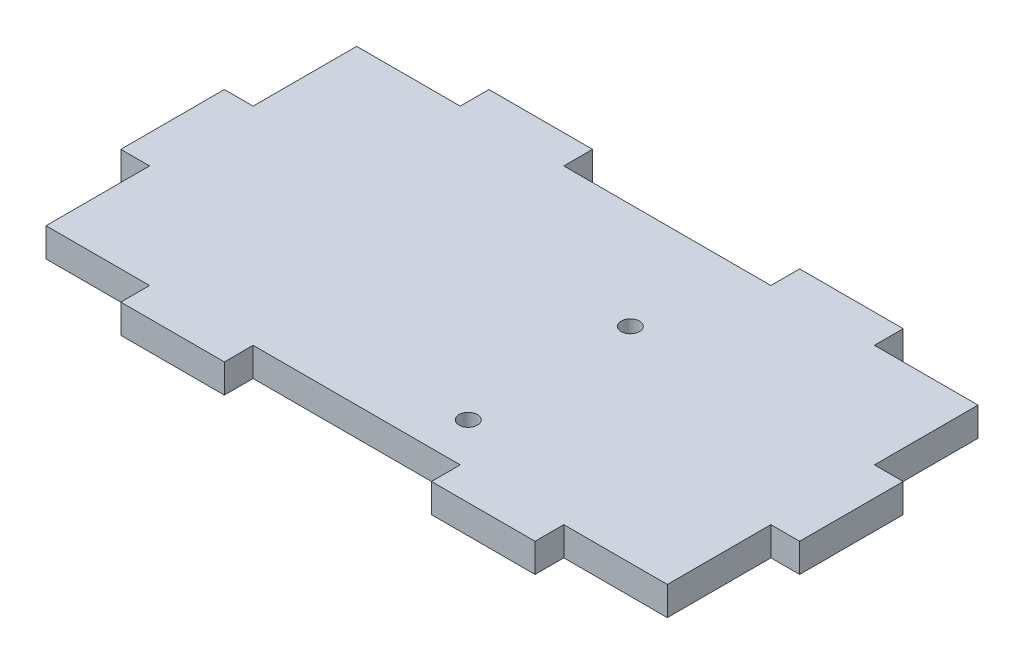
ISO-10303-21;
HEADER;
FILE_DESCRIPTION(('STEP AP214'),'2;1');
FILE_NAME('part.step','',(''),(''),'','','');
FILE_SCHEMA(('AUTOMOTIVE_DESIGN { 1 0 10303 214 1 1 1 1 }'));
ENDSEC;
DATA;
#1=APPLICATION_CONTEXT('core data for automotive mechanical design processes');
#2=APPLICATION_PROTOCOL_DEFINITION('international standard','automotive_design',2000,#1);
#3=PRODUCT_CONTEXT('',#1,'mechanical');
#4=PRODUCT('Part','Part','',(#3));
#5=PRODUCT_RELATED_PRODUCT_CATEGORY('part','',(#4));
#6=PRODUCT_DEFINITION_FORMATION('','',#4);
#7=PRODUCT_DEFINITION_CONTEXT('part definition',#1,'design');
#8=PRODUCT_DEFINITION('design','',#6,#7);
#9=PRODUCT_DEFINITION_SHAPE('','',#8);
#10=(LENGTH_UNIT() NAMED_UNIT(*) SI_UNIT(.MILLI.,.METRE.));
#11=(NAMED_UNIT(*) PLANE_ANGLE_UNIT() SI_UNIT($,.RADIAN.));
#12=(NAMED_UNIT(*) SI_UNIT($,.STERADIAN.) SOLID_ANGLE_UNIT());
#13=UNCERTAINTY_MEASURE_WITH_UNIT(LENGTH_MEASURE(1.E-05),#10,'distance_accuracy_value','');
#14=(GEOMETRIC_REPRESENTATION_CONTEXT(3) GLOBAL_UNCERTAINTY_ASSIGNED_CONTEXT((#13)) GLOBAL_UNIT_ASSIGNED_CONTEXT((#10,
#11,#12)) REPRESENTATION_CONTEXT('',''));
#15=CARTESIAN_POINT('',(0.,0.,0.));
#16=DIRECTION('',(0.,0.,1.));
#17=DIRECTION('',(1.,0.,0.));
#18=AXIS2_PLACEMENT_3D('',#15,#16,#17);
#19=CARTESIAN_POINT('',(-54.,5.,-27.));
#20=DIRECTION('',(1.,0.,0.));
#21=DIRECTION('',(0.,0.,-1.));
#22=AXIS2_PLACEMENT_3D('',#19,#20,#21);
#23=PLANE('',#22);
#24=DIRECTION('',(0.,1.,0.));
#25=VECTOR('',#24,1.);
#26=CARTESIAN_POINT('',(-54.,-18.6815416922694,9.));
#27=LINE('',#26,#25);
#28=CARTESIAN_POINT('',(-54.,0.,9.));
#29=VERTEX_POINT('',#28);
#30=CARTESIAN_POINT('',(-54.,5.,9.));
#31=VERTEX_POINT('',#30);
#32=EDGE_CURVE('E241',#29,#31,#27,.T.);
#33=ORIENTED_EDGE('',*,*,#32,.F.);
#34=DIRECTION('',(0.,0.,1.));
#35=VECTOR('',#34,1.);
#36=CARTESIAN_POINT('',(-54.,0.,-27.));
#37=LINE('',#36,#35);
#38=CARTESIAN_POINT('',(-54.,0.,27.));
#39=VERTEX_POINT('',#38);
#40=EDGE_CURVE('E411',#29,#39,#37,.T.);
#41=ORIENTED_EDGE('',*,*,#40,.T.);
#42=DIRECTION('',(0.,-1.,0.));
#43=VECTOR('',#42,1.);
#44=CARTESIAN_POINT('',(-54.,5.,27.));
#45=LINE('',#44,#43);
#46=CARTESIAN_POINT('',(-54.,5.,27.));
#47=VERTEX_POINT('',#46);
#48=EDGE_CURVE('E421',#47,#39,#45,.T.);
#49=ORIENTED_EDGE('',*,*,#48,.F.);
#50=DIRECTION('',(0.,0.,1.));
#51=VECTOR('',#50,1.);
#52=CARTESIAN_POINT('',(-54.,5.,-27.));
#53=LINE('',#52,#51);
#54=EDGE_CURVE('E398',#31,#47,#53,.T.);
#55=ORIENTED_EDGE('',*,*,#54,.F.);
#56=EDGE_LOOP('',(#33,#41,#49,#55));
#57=FACE_BOUND('',#56,.T.);
#58=ADVANCED_FACE('F32',(#57),#23,.F.);
#59=CARTESIAN_POINT('',(-54.,5.,27.));
#60=DIRECTION('',(0.,0.,-1.));
#61=DIRECTION('',(-1.,0.,0.));
#62=AXIS2_PLACEMENT_3D('',#59,#60,#61);
#63=PLANE('',#62);
#64=DIRECTION('',(0.,1.,0.));
#65=VECTOR('',#64,1.);
#66=CARTESIAN_POINT('',(-18.,-18.6815416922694,27.));
#67=LINE('',#66,#65);
#68=CARTESIAN_POINT('',(-18.,0.,27.));
#69=VERTEX_POINT('',#68);
#70=CARTESIAN_POINT('',(-18.,5.,27.));
#71=VERTEX_POINT('',#70);
#72=EDGE_CURVE('E272',#69,#71,#67,.T.);
#73=ORIENTED_EDGE('',*,*,#72,.F.);
#74=DIRECTION('',(1.,0.,0.));
#75=VECTOR('',#74,1.);
#76=CARTESIAN_POINT('',(-54.,0.,27.));
#77=LINE('',#76,#75);
#78=CARTESIAN_POINT('',(18.,0.,27.));
#79=VERTEX_POINT('',#78);
#80=EDGE_CURVE('E418',#69,#79,#77,.T.);
#81=ORIENTED_EDGE('',*,*,#80,.T.);
#82=DIRECTION('',(0.,1.,0.));
#83=VECTOR('',#82,1.);
#84=CARTESIAN_POINT('',(18.,-18.6815416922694,27.));
#85=LINE('',#84,#83);
#86=CARTESIAN_POINT('',(18.,5.,27.));
#87=VERTEX_POINT('',#86);
#88=EDGE_CURVE('E311',#79,#87,#85,.T.);
#89=ORIENTED_EDGE('',*,*,#88,.T.);
#90=DIRECTION('',(1.,0.,0.));
#91=VECTOR('',#90,1.);
#92=CARTESIAN_POINT('',(-54.,5.,27.));
#93=LINE('',#92,#91);
#94=EDGE_CURVE('E49',#71,#87,#93,.T.);
#95=ORIENTED_EDGE('',*,*,#94,.F.);
#96=EDGE_LOOP('',(#73,#81,#89,#95));
#97=FACE_BOUND('',#96,.T.);
#98=ADVANCED_FACE('F456',(#97),#63,.F.);
#99=DIRECTION('',(0.,1.,0.));
#100=VECTOR('',#99,1.);
#101=CARTESIAN_POINT('',(-36.,-18.6815416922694,27.));
#102=LINE('',#101,#100);
#103=CARTESIAN_POINT('',(-36.,0.,27.));
#104=VERTEX_POINT('',#103);
#105=CARTESIAN_POINT('',(-36.,5.,27.));
#106=VERTEX_POINT('',#105);
#107=EDGE_CURVE('E57',#104,#106,#102,.T.);
#108=ORIENTED_EDGE('',*,*,#107,.T.);
#109=EDGE_CURVE('E403',#47,#106,#93,.T.);
#110=ORIENTED_EDGE('',*,*,#109,.F.);
#111=ORIENTED_EDGE('',*,*,#48,.T.);
#112=EDGE_CURVE('E416',#39,#104,#77,.T.);
#113=ORIENTED_EDGE('',*,*,#112,.T.);
#114=EDGE_LOOP('',(#108,#110,#111,#113));
#115=FACE_BOUND('',#114,.T.);
#116=ADVANCED_FACE('F461',(#115),#63,.F.);
#117=DIRECTION('',(0.,1.,0.));
#118=VECTOR('',#117,1.);
#119=CARTESIAN_POINT('',(36.,-18.6815416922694,27.));
#120=LINE('',#119,#118);
#121=CARTESIAN_POINT('',(36.,0.,27.));
#122=VERTEX_POINT('',#121);
#123=CARTESIAN_POINT('',(36.,5.,27.));
#124=VERTEX_POINT('',#123);
#125=EDGE_CURVE('E307',#122,#124,#120,.T.);
#126=ORIENTED_EDGE('',*,*,#125,.F.);
#127=CARTESIAN_POINT('',(54.,0.,27.));
#128=VERTEX_POINT('',#127);
#129=EDGE_CURVE('E415',#122,#128,#77,.T.);
#130=ORIENTED_EDGE('',*,*,#129,.T.);
#131=DIRECTION('',(0.,-1.,0.));
#132=VECTOR('',#131,1.);
#133=CARTESIAN_POINT('',(54.,5.,27.));
#134=LINE('',#133,#132);
#135=CARTESIAN_POINT('',(54.,5.,27.));
#136=VERTEX_POINT('',#135);
#137=EDGE_CURVE('E405',#136,#128,#134,.T.);
#138=ORIENTED_EDGE('',*,*,#137,.F.);
#139=EDGE_CURVE('E402',#124,#136,#93,.T.);
#140=ORIENTED_EDGE('',*,*,#139,.F.);
#141=EDGE_LOOP('',(#126,#130,#138,#140));
#142=FACE_BOUND('',#141,.T.);
#143=ADVANCED_FACE('F463',(#142),#63,.F.);
#144=CARTESIAN_POINT('',(54.,5.,-27.));
#145=DIRECTION('',(-1.,0.,0.));
#146=DIRECTION('',(0.,0.,1.));
#147=AXIS2_PLACEMENT_3D('',#144,#145,#146);
#148=PLANE('',#147);
#149=DIRECTION('',(0.,1.,0.));
#150=VECTOR('',#149,1.);
#151=CARTESIAN_POINT('',(54.,-18.6815416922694,-9.00000000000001));
#152=LINE('',#151,#150);
#153=CARTESIAN_POINT('',(54.,0.,-9.00000000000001));
#154=VERTEX_POINT('',#153);
#155=CARTESIAN_POINT('',(54.,5.,-9.00000000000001));
#156=VERTEX_POINT('',#155);
#157=EDGE_CURVE('E319',#154,#156,#152,.T.);
#158=ORIENTED_EDGE('',*,*,#157,.F.);
#159=DIRECTION('',(0.,0.,-1.));
#160=VECTOR('',#159,1.);
#161=CARTESIAN_POINT('',(54.,0.,-27.));
#162=LINE('',#161,#160);
#163=CARTESIAN_POINT('',(54.,0.,-27.));
#164=VERTEX_POINT('',#163);
#165=EDGE_CURVE('E372',#154,#164,#162,.T.);
#166=ORIENTED_EDGE('',*,*,#165,.T.);
#167=DIRECTION('',(0.,-1.,0.));
#168=VECTOR('',#167,1.);
#169=CARTESIAN_POINT('',(54.,5.,-27.));
#170=LINE('',#169,#168);
#171=CARTESIAN_POINT('',(54.,5.,-27.));
#172=VERTEX_POINT('',#171);
#173=EDGE_CURVE('E11',#172,#164,#170,.T.);
#174=ORIENTED_EDGE('',*,*,#173,.F.);
#175=DIRECTION('',(0.,0.,-1.));
#176=VECTOR('',#175,1.);
#177=CARTESIAN_POINT('',(54.,5.,-27.));
#178=LINE('',#177,#176);
#179=EDGE_CURVE('E394',#156,#172,#178,.T.);
#180=ORIENTED_EDGE('',*,*,#179,.F.);
#181=EDGE_LOOP('',(#158,#166,#174,#180));
#182=FACE_BOUND('',#181,.T.);
#183=ADVANCED_FACE('F467',(#182),#148,.F.);
#184=CARTESIAN_POINT('',(-54.,5.,-27.));
#185=DIRECTION('',(0.,0.,1.));
#186=DIRECTION('',(1.,0.,0.));
#187=AXIS2_PLACEMENT_3D('',#184,#185,#186);
#188=PLANE('',#187);
#189=DIRECTION('',(0.,1.,0.));
#190=VECTOR('',#189,1.);
#191=CARTESIAN_POINT('',(18.,-18.6815416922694,-27.));
#192=LINE('',#191,#190);
#193=CARTESIAN_POINT('',(18.,0.,-27.));
#194=VERTEX_POINT('',#193);
#195=CARTESIAN_POINT('',(18.,5.,-27.));
#196=VERTEX_POINT('',#195);
#197=EDGE_CURVE('E347',#194,#196,#192,.T.);
#198=ORIENTED_EDGE('',*,*,#197,.F.);
#199=DIRECTION('',(-1.,0.,0.));
#200=VECTOR('',#199,1.);
#201=CARTESIAN_POINT('',(-54.,0.,-27.));
#202=LINE('',#201,#200);
#203=CARTESIAN_POINT('',(-18.,0.,-27.));
#204=VERTEX_POINT('',#203);
#205=EDGE_CURVE('E412',#194,#204,#202,.T.);
#206=ORIENTED_EDGE('',*,*,#205,.T.);
#207=DIRECTION('',(0.,1.,0.));
#208=VECTOR('',#207,1.);
#209=CARTESIAN_POINT('',(-18.,-18.6815416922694,-27.));
#210=LINE('',#209,#208);
#211=CARTESIAN_POINT('',(-18.,5.,-27.));
#212=VERTEX_POINT('',#211);
#213=EDGE_CURVE('E385',#204,#212,#210,.T.);
#214=ORIENTED_EDGE('',*,*,#213,.T.);
#215=DIRECTION('',(-1.,0.,0.));
#216=VECTOR('',#215,1.);
#217=CARTESIAN_POINT('',(-54.,5.,-27.));
#218=LINE('',#217,#216);
#219=EDGE_CURVE('E399',#196,#212,#218,.T.);
#220=ORIENTED_EDGE('',*,*,#219,.F.);
#221=EDGE_LOOP('',(#198,#206,#214,#220));
#222=FACE_BOUND('',#221,.T.);
#223=ADVANCED_FACE('F464',(#222),#188,.F.);
#224=DIRECTION('',(0.,1.,0.));
#225=VECTOR('',#224,1.);
#226=CARTESIAN_POINT('',(36.,-18.6815416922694,-27.));
#227=LINE('',#226,#225);
#228=CARTESIAN_POINT('',(36.,0.,-27.));
#229=VERTEX_POINT('',#228);
#230=CARTESIAN_POINT('',(36.,5.,-27.));
#231=VERTEX_POINT('',#230);
#232=EDGE_CURVE('E345',#229,#231,#227,.T.);
#233=ORIENTED_EDGE('',*,*,#232,.T.);
#234=EDGE_CURVE('E395',#172,#231,#218,.T.);
#235=ORIENTED_EDGE('',*,*,#234,.F.);
#236=ORIENTED_EDGE('',*,*,#173,.T.);
#237=EDGE_CURVE('E409',#164,#229,#202,.T.);
#238=ORIENTED_EDGE('',*,*,#237,.T.);
#239=EDGE_LOOP('',(#233,#235,#236,#238));
#240=FACE_BOUND('',#239,.T.);
#241=ADVANCED_FACE('F466',(#240),#188,.F.);
#242=DIRECTION('',(0.,1.,0.));
#243=VECTOR('',#242,1.);
#244=CARTESIAN_POINT('',(-36.,-18.6815416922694,-27.));
#245=LINE('',#244,#243);
#246=CARTESIAN_POINT('',(-36.,0.,-27.));
#247=VERTEX_POINT('',#246);
#248=CARTESIAN_POINT('',(-36.,5.,-27.));
#249=VERTEX_POINT('',#248);
#250=EDGE_CURVE('E381',#247,#249,#245,.T.);
#251=ORIENTED_EDGE('',*,*,#250,.F.);
#252=CARTESIAN_POINT('',(-54.,0.,-27.));
#253=VERTEX_POINT('',#252);
#254=EDGE_CURVE('E408',#247,#253,#202,.T.);
#255=ORIENTED_EDGE('',*,*,#254,.T.);
#256=DIRECTION('',(0.,-1.,0.));
#257=VECTOR('',#256,1.);
#258=CARTESIAN_POINT('',(-54.,5.,-27.));
#259=LINE('',#258,#257);
#260=CARTESIAN_POINT('',(-54.,5.,-27.));
#261=VERTEX_POINT('',#260);
#262=EDGE_CURVE('E41',#261,#253,#259,.T.);
#263=ORIENTED_EDGE('',*,*,#262,.F.);
#264=EDGE_CURVE('E393',#249,#261,#218,.T.);
#265=ORIENTED_EDGE('',*,*,#264,.F.);
#266=EDGE_LOOP('',(#251,#255,#263,#265));
#267=FACE_BOUND('',#266,.T.);
#268=ADVANCED_FACE('F469',(#267),#188,.F.);
#269=CARTESIAN_POINT('',(54.,0.,9.00000000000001));
#270=VERTEX_POINT('',#269);
#271=EDGE_CURVE('E406',#128,#270,#162,.T.);
#272=ORIENTED_EDGE('',*,*,#271,.T.);
#273=DIRECTION('',(0.,1.,0.));
#274=VECTOR('',#273,1.);
#275=CARTESIAN_POINT('',(54.,-18.6815416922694,9.00000000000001));
#276=LINE('',#275,#274);
#277=CARTESIAN_POINT('',(54.,5.,9.00000000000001));
#278=VERTEX_POINT('',#277);
#279=EDGE_CURVE('E281',#270,#278,#276,.T.);
#280=ORIENTED_EDGE('',*,*,#279,.T.);
#281=EDGE_CURVE('E390',#136,#278,#178,.T.);
#282=ORIENTED_EDGE('',*,*,#281,.F.);
#283=ORIENTED_EDGE('',*,*,#137,.T.);
#284=EDGE_LOOP('',(#272,#280,#282,#283));
#285=FACE_BOUND('',#284,.T.);
#286=ADVANCED_FACE('F34',(#285),#148,.F.);
#287=CARTESIAN_POINT('',(-54.,0.,-9.));
#288=VERTEX_POINT('',#287);
#289=EDGE_CURVE('E413',#253,#288,#37,.T.);
#290=ORIENTED_EDGE('',*,*,#289,.T.);
#291=DIRECTION('',(0.,1.,0.));
#292=VECTOR('',#291,1.);
#293=CARTESIAN_POINT('',(-54.,-18.6815416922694,-9.));
#294=LINE('',#293,#292);
#295=CARTESIAN_POINT('',(-54.,5.,-9.));
#296=VERTEX_POINT('',#295);
#297=EDGE_CURVE('E233',#288,#296,#294,.T.);
#298=ORIENTED_EDGE('',*,*,#297,.T.);
#299=EDGE_CURVE('E400',#261,#296,#53,.T.);
#300=ORIENTED_EDGE('',*,*,#299,.F.);
#301=ORIENTED_EDGE('',*,*,#262,.T.);
#302=EDGE_LOOP('',(#290,#298,#300,#301));
#303=FACE_BOUND('',#302,.T.);
#304=ADVANCED_FACE('F442',(#303),#23,.F.);
#305=CARTESIAN_POINT('',(0.,5.,0.));
#306=DIRECTION('',(0.,1.,0.));
#307=DIRECTION('',(0.,0.,1.));
#308=AXIS2_PLACEMENT_3D('',#305,#306,#307);
#309=PLANE('',#308);
#310=CARTESIAN_POINT('',(11.9310270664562,5.,-8.645395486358));
#311=DIRECTION('',(0.,1.,0.));
#312=DIRECTION('',(0.,0.,1.));
#313=AXIS2_PLACEMENT_3D('',#310,#311,#312);
#314=CIRCLE('',#313,1.58856579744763);
#315=CARTESIAN_POINT('',(11.9310270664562,5.,-7.05682968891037));
#316=VERTEX_POINT('',#315);
#317=EDGE_CURVE('E426',#316,#316,#314,.T.);
#318=ORIENTED_EDGE('',*,*,#317,.F.);
#319=EDGE_LOOP('',(#318));
#320=FACE_BOUND('',#319,.T.);
#321=CARTESIAN_POINT('',(11.9196271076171,5.,19.5212149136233));
#322=DIRECTION('',(0.,1.,0.));
#323=DIRECTION('',(0.,0.,1.));
#324=AXIS2_PLACEMENT_3D('',#321,#322,#323);
#325=CIRCLE('',#324,1.60000000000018);
#326=CARTESIAN_POINT('',(11.9196271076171,5.,21.1212149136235));
#327=VERTEX_POINT('',#326);
#328=EDGE_CURVE('E430',#327,#327,#325,.T.);
#329=ORIENTED_EDGE('',*,*,#328,.F.);
#330=EDGE_LOOP('',(#329));
#331=FACE_BOUND('',#330,.T.);
#332=DIRECTION('',(-1.,0.,0.));
#333=VECTOR('',#332,1.);
#334=CARTESIAN_POINT('',(-54.,5.,9.));
#335=LINE('',#334,#333);
#336=CARTESIAN_POINT('',(-59.,5.,9.));
#337=VERTEX_POINT('',#336);
#338=EDGE_CURVE('E226',#31,#337,#335,.T.);
#339=ORIENTED_EDGE('',*,*,#338,.F.);
#340=ORIENTED_EDGE('',*,*,#54,.T.);
#341=ORIENTED_EDGE('',*,*,#109,.T.);
#342=DIRECTION('',(0.,0.,-1.));
#343=VECTOR('',#342,1.);
#344=CARTESIAN_POINT('',(-36.,5.,27.));
#345=LINE('',#344,#343);
#346=CARTESIAN_POINT('',(-36.,5.,32.));
#347=VERTEX_POINT('',#346);
#348=EDGE_CURVE('E261',#347,#106,#345,.T.);
#349=ORIENTED_EDGE('',*,*,#348,.F.);
#350=DIRECTION('',(-1.,0.,0.));
#351=VECTOR('',#350,1.);
#352=CARTESIAN_POINT('',(-36.,5.,32.));
#353=LINE('',#352,#351);
#354=CARTESIAN_POINT('',(-18.,5.,32.));
#355=VERTEX_POINT('',#354);
#356=EDGE_CURVE('E264',#355,#347,#353,.T.);
#357=ORIENTED_EDGE('',*,*,#356,.F.);
#358=DIRECTION('',(0.,0.,1.));
#359=VECTOR('',#358,1.);
#360=CARTESIAN_POINT('',(-18.,5.,27.));
#361=LINE('',#360,#359);
#362=EDGE_CURVE('E267',#71,#355,#361,.T.);
#363=ORIENTED_EDGE('',*,*,#362,.F.);
#364=ORIENTED_EDGE('',*,*,#94,.T.);
#365=DIRECTION('',(0.,0.,1.));
#366=VECTOR('',#365,1.);
#367=CARTESIAN_POINT('',(18.,5.,27.));
#368=LINE('',#367,#366);
#369=CARTESIAN_POINT('',(18.,5.,32.));
#370=VERTEX_POINT('',#369);
#371=EDGE_CURVE('E301',#87,#370,#368,.T.);
#372=ORIENTED_EDGE('',*,*,#371,.T.);
#373=DIRECTION('',(1.,0.,0.));
#374=VECTOR('',#373,1.);
#375=CARTESIAN_POINT('',(36.,5.,32.));
#376=LINE('',#375,#374);
#377=CARTESIAN_POINT('',(36.,5.,32.));
#378=VERTEX_POINT('',#377);
#379=EDGE_CURVE('E304',#370,#378,#376,.T.);
#380=ORIENTED_EDGE('',*,*,#379,.T.);
#381=DIRECTION('',(0.,0.,-1.));
#382=VECTOR('',#381,1.);
#383=CARTESIAN_POINT('',(36.,5.,27.));
#384=LINE('',#383,#382);
#385=EDGE_CURVE('E289',#378,#124,#384,.T.);
#386=ORIENTED_EDGE('',*,*,#385,.T.);
#387=ORIENTED_EDGE('',*,*,#139,.T.);
#388=ORIENTED_EDGE('',*,*,#281,.T.);
#389=DIRECTION('',(1.,0.,0.));
#390=VECTOR('',#389,1.);
#391=CARTESIAN_POINT('',(54.,5.,9.00000000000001));
#392=LINE('',#391,#390);
#393=CARTESIAN_POINT('',(59.,5.,9.00000000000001));
#394=VERTEX_POINT('',#393);
#395=EDGE_CURVE('E260',#278,#394,#392,.T.);
#396=ORIENTED_EDGE('',*,*,#395,.T.);
#397=DIRECTION('',(0.,0.,1.));
#398=VECTOR('',#397,1.);
#399=CARTESIAN_POINT('',(59.,5.,-9.00000000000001));
#400=LINE('',#399,#398);
#401=CARTESIAN_POINT('',(59.,5.,-9.00000000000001));
#402=VERTEX_POINT('',#401);
#403=EDGE_CURVE('E298',#402,#394,#400,.T.);
#404=ORIENTED_EDGE('',*,*,#403,.F.);
#405=DIRECTION('',(1.,0.,0.));
#406=VECTOR('',#405,1.);
#407=CARTESIAN_POINT('',(54.,5.,-9.00000000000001));
#408=LINE('',#407,#406);
#409=EDGE_CURVE('E323',#156,#402,#408,.T.);
#410=ORIENTED_EDGE('',*,*,#409,.F.);
#411=ORIENTED_EDGE('',*,*,#179,.T.);
#412=ORIENTED_EDGE('',*,*,#234,.T.);
#413=DIRECTION('',(0.,0.,1.));
#414=VECTOR('',#413,1.);
#415=CARTESIAN_POINT('',(36.,5.,-27.));
#416=LINE('',#415,#414);
#417=CARTESIAN_POINT('',(36.,5.,-32.));
#418=VERTEX_POINT('',#417);
#419=EDGE_CURVE('E321',#418,#231,#416,.T.);
#420=ORIENTED_EDGE('',*,*,#419,.F.);
#421=DIRECTION('',(1.,0.,0.));
#422=VECTOR('',#421,1.);
#423=CARTESIAN_POINT('',(36.,5.,-32.));
#424=LINE('',#423,#422);
#425=CARTESIAN_POINT('',(18.,5.,-32.));
#426=VERTEX_POINT('',#425);
#427=EDGE_CURVE('E338',#426,#418,#424,.T.);
#428=ORIENTED_EDGE('',*,*,#427,.F.);
#429=DIRECTION('',(0.,0.,-1.));
#430=VECTOR('',#429,1.);
#431=CARTESIAN_POINT('',(18.,5.,-27.));
#432=LINE('',#431,#430);
#433=EDGE_CURVE('E341',#196,#426,#432,.T.);
#434=ORIENTED_EDGE('',*,*,#433,.F.);
#435=ORIENTED_EDGE('',*,*,#219,.T.);
#436=DIRECTION('',(0.,0.,-1.));
#437=VECTOR('',#436,1.);
#438=CARTESIAN_POINT('',(-18.,5.,-27.));
#439=LINE('',#438,#437);
#440=CARTESIAN_POINT('',(-18.,5.,-32.));
#441=VERTEX_POINT('',#440);
#442=EDGE_CURVE('E375',#212,#441,#439,.T.);
#443=ORIENTED_EDGE('',*,*,#442,.T.);
#444=DIRECTION('',(-1.,0.,0.));
#445=VECTOR('',#444,1.);
#446=CARTESIAN_POINT('',(-36.,5.,-32.));
#447=LINE('',#446,#445);
#448=CARTESIAN_POINT('',(-36.,5.,-32.));
#449=VERTEX_POINT('',#448);
#450=EDGE_CURVE('E378',#441,#449,#447,.T.);
#451=ORIENTED_EDGE('',*,*,#450,.T.);
#452=DIRECTION('',(0.,0.,1.));
#453=VECTOR('',#452,1.);
#454=CARTESIAN_POINT('',(-36.,5.,-27.));
#455=LINE('',#454,#453);
#456=EDGE_CURVE('E363',#449,#249,#455,.T.);
#457=ORIENTED_EDGE('',*,*,#456,.T.);
#458=ORIENTED_EDGE('',*,*,#264,.T.);
#459=ORIENTED_EDGE('',*,*,#299,.T.);
#460=DIRECTION('',(-1.,0.,0.));
#461=VECTOR('',#460,1.);
#462=CARTESIAN_POINT('',(-54.,5.,-9.));
#463=LINE('',#462,#461);
#464=CARTESIAN_POINT('',(-59.,5.,-9.));
#465=VERTEX_POINT('',#464);
#466=EDGE_CURVE('E230',#296,#465,#463,.T.);
#467=ORIENTED_EDGE('',*,*,#466,.T.);
#468=DIRECTION('',(0.,0.,1.));
#469=VECTOR('',#468,1.);
#470=CARTESIAN_POINT('',(-59.,5.,-9.));
#471=LINE('',#470,#469);
#472=EDGE_CURVE('E222',#465,#337,#471,.T.);
#473=ORIENTED_EDGE('',*,*,#472,.T.);
#474=EDGE_LOOP('',(#339,#340,#341,#349,#357,#363,#364,#372,#380,#386,#387,#388,#396,#404,#410,
#411,#412,#420,#428,#434,#435,#443,#451,#457,#458,#459,#467,#473));
#475=FACE_BOUND('',#474,.T.);
#476=ADVANCED_FACE('F224',(#320,#331,#475),#309,.T.);
#477=CARTESIAN_POINT('',(0.,0.,0.));
#478=DIRECTION('',(0.,1.,0.));
#479=DIRECTION('',(0.,0.,1.));
#480=AXIS2_PLACEMENT_3D('',#477,#478,#479);
#481=PLANE('',#480);
#482=CARTESIAN_POINT('',(11.9310270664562,0.,-8.645395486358));
#483=DIRECTION('',(0.,1.,0.));
#484=DIRECTION('',(0.,0.,1.));
#485=AXIS2_PLACEMENT_3D('',#482,#483,#484);
#486=CIRCLE('',#485,1.58856579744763);
#487=CARTESIAN_POINT('',(11.9310270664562,0.,-7.05682968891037));
#488=VERTEX_POINT('',#487);
#489=EDGE_CURVE('E36',#488,#488,#486,.T.);
#490=ORIENTED_EDGE('',*,*,#489,.T.);
#491=EDGE_LOOP('',(#490));
#492=FACE_BOUND('',#491,.T.);
#493=CARTESIAN_POINT('',(11.9196271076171,0.,19.5212149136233));
#494=DIRECTION('',(0.,1.,0.));
#495=DIRECTION('',(0.,0.,1.));
#496=AXIS2_PLACEMENT_3D('',#493,#494,#495);
#497=CIRCLE('',#496,1.60000000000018);
#498=CARTESIAN_POINT('',(11.9196271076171,0.,21.1212149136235));
#499=VERTEX_POINT('',#498);
#500=EDGE_CURVE('E247',#499,#499,#497,.T.);
#501=ORIENTED_EDGE('',*,*,#500,.T.);
#502=EDGE_LOOP('',(#501));
#503=FACE_BOUND('',#502,.T.);
#504=ORIENTED_EDGE('',*,*,#40,.F.);
#505=DIRECTION('',(1.,0.,0.));
#506=VECTOR('',#505,1.);
#507=CARTESIAN_POINT('',(-54.,0.,9.));
#508=LINE('',#507,#506);
#509=CARTESIAN_POINT('',(-59.,0.,9.));
#510=VERTEX_POINT('',#509);
#511=EDGE_CURVE('E250',#510,#29,#508,.T.);
#512=ORIENTED_EDGE('',*,*,#511,.F.);
#513=DIRECTION('',(0.,0.,-1.));
#514=VECTOR('',#513,1.);
#515=CARTESIAN_POINT('',(-59.,0.,-9.));
#516=LINE('',#515,#514);
#517=CARTESIAN_POINT('',(-59.,0.,-9.));
#518=VERTEX_POINT('',#517);
#519=EDGE_CURVE('E238',#510,#518,#516,.T.);
#520=ORIENTED_EDGE('',*,*,#519,.T.);
#521=DIRECTION('',(1.,0.,0.));
#522=VECTOR('',#521,1.);
#523=CARTESIAN_POINT('',(-54.,0.,-9.));
#524=LINE('',#523,#522);
#525=EDGE_CURVE('E356',#518,#288,#524,.T.);
#526=ORIENTED_EDGE('',*,*,#525,.T.);
#527=ORIENTED_EDGE('',*,*,#289,.F.);
#528=ORIENTED_EDGE('',*,*,#254,.F.);
#529=DIRECTION('',(0.,0.,-1.));
#530=VECTOR('',#529,1.);
#531=CARTESIAN_POINT('',(-36.,0.,-27.));
#532=LINE('',#531,#530);
#533=CARTESIAN_POINT('',(-36.,0.,-32.));
#534=VERTEX_POINT('',#533);
#535=EDGE_CURVE('E370',#247,#534,#532,.T.);
#536=ORIENTED_EDGE('',*,*,#535,.T.);
#537=DIRECTION('',(1.,0.,0.));
#538=VECTOR('',#537,1.);
#539=CARTESIAN_POINT('',(-36.,0.,-32.));
#540=LINE('',#539,#538);
#541=CARTESIAN_POINT('',(-18.,0.,-32.));
#542=VERTEX_POINT('',#541);
#543=EDGE_CURVE('E367',#534,#542,#540,.T.);
#544=ORIENTED_EDGE('',*,*,#543,.T.);
#545=DIRECTION('',(0.,0.,1.));
#546=VECTOR('',#545,1.);
#547=CARTESIAN_POINT('',(-18.,0.,-27.));
#548=LINE('',#547,#546);
#549=EDGE_CURVE('E364',#542,#204,#548,.T.);
#550=ORIENTED_EDGE('',*,*,#549,.T.);
#551=ORIENTED_EDGE('',*,*,#205,.F.);
#552=DIRECTION('',(0.,0.,1.));
#553=VECTOR('',#552,1.);
#554=CARTESIAN_POINT('',(18.,0.,-27.));
#555=LINE('',#554,#553);
#556=CARTESIAN_POINT('',(18.,0.,-32.));
#557=VERTEX_POINT('',#556);
#558=EDGE_CURVE('E329',#557,#194,#555,.T.);
#559=ORIENTED_EDGE('',*,*,#558,.F.);
#560=DIRECTION('',(-1.,0.,0.));
#561=VECTOR('',#560,1.);
#562=CARTESIAN_POINT('',(36.,0.,-32.));
#563=LINE('',#562,#561);
#564=CARTESIAN_POINT('',(36.,0.,-32.));
#565=VERTEX_POINT('',#564);
#566=EDGE_CURVE('E333',#565,#557,#563,.T.);
#567=ORIENTED_EDGE('',*,*,#566,.F.);
#568=DIRECTION('',(0.,0.,-1.));
#569=VECTOR('',#568,1.);
#570=CARTESIAN_POINT('',(36.,0.,-27.));
#571=LINE('',#570,#569);
#572=EDGE_CURVE('E332',#229,#565,#571,.T.);
#573=ORIENTED_EDGE('',*,*,#572,.F.);
#574=ORIENTED_EDGE('',*,*,#237,.F.);
#575=ORIENTED_EDGE('',*,*,#165,.F.);
#576=DIRECTION('',(-1.,0.,0.));
#577=VECTOR('',#576,1.);
#578=CARTESIAN_POINT('',(54.,0.,-9.00000000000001));
#579=LINE('',#578,#577);
#580=CARTESIAN_POINT('',(59.,0.,-9.00000000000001));
#581=VERTEX_POINT('',#580);
#582=EDGE_CURVE('E318',#581,#154,#579,.T.);
#583=ORIENTED_EDGE('',*,*,#582,.F.);
#584=DIRECTION('',(0.,0.,-1.));
#585=VECTOR('',#584,1.);
#586=CARTESIAN_POINT('',(59.,0.,-9.00000000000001));
#587=LINE('',#586,#585);
#588=CARTESIAN_POINT('',(59.,0.,9.00000000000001));
#589=VERTEX_POINT('',#588);
#590=EDGE_CURVE('E315',#589,#581,#587,.T.);
#591=ORIENTED_EDGE('',*,*,#590,.F.);
#592=DIRECTION('',(-1.,0.,0.));
#593=VECTOR('',#592,1.);
#594=CARTESIAN_POINT('',(54.,0.,9.00000000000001));
#595=LINE('',#594,#593);
#596=EDGE_CURVE('E285',#589,#270,#595,.T.);
#597=ORIENTED_EDGE('',*,*,#596,.T.);
#598=ORIENTED_EDGE('',*,*,#271,.F.);
#599=ORIENTED_EDGE('',*,*,#129,.F.);
#600=DIRECTION('',(0.,0.,1.));
#601=VECTOR('',#600,1.);
#602=CARTESIAN_POINT('',(36.,0.,27.));
#603=LINE('',#602,#601);
#604=CARTESIAN_POINT('',(36.,0.,32.));
#605=VERTEX_POINT('',#604);
#606=EDGE_CURVE('E296',#122,#605,#603,.T.);
#607=ORIENTED_EDGE('',*,*,#606,.T.);
#608=DIRECTION('',(-1.,0.,0.));
#609=VECTOR('',#608,1.);
#610=CARTESIAN_POINT('',(36.,0.,32.));
#611=LINE('',#610,#609);
#612=CARTESIAN_POINT('',(18.,0.,32.));
#613=VERTEX_POINT('',#612);
#614=EDGE_CURVE('E293',#605,#613,#611,.T.);
#615=ORIENTED_EDGE('',*,*,#614,.T.);
#616=DIRECTION('',(0.,0.,-1.));
#617=VECTOR('',#616,1.);
#618=CARTESIAN_POINT('',(18.,0.,27.));
#619=LINE('',#618,#617);
#620=EDGE_CURVE('E290',#613,#79,#619,.T.);
#621=ORIENTED_EDGE('',*,*,#620,.T.);
#622=ORIENTED_EDGE('',*,*,#80,.F.);
#623=DIRECTION('',(0.,0.,-1.));
#624=VECTOR('',#623,1.);
#625=CARTESIAN_POINT('',(-18.,0.,27.));
#626=LINE('',#625,#624);
#627=CARTESIAN_POINT('',(-18.,0.,32.));
#628=VERTEX_POINT('',#627);
#629=EDGE_CURVE('E253',#628,#69,#626,.T.);
#630=ORIENTED_EDGE('',*,*,#629,.F.);
#631=DIRECTION('',(1.,0.,0.));
#632=VECTOR('',#631,1.);
#633=CARTESIAN_POINT('',(-36.,0.,32.));
#634=LINE('',#633,#632);
#635=CARTESIAN_POINT('',(-36.,0.,32.));
#636=VERTEX_POINT('',#635);
#637=EDGE_CURVE('E257',#636,#628,#634,.T.);
#638=ORIENTED_EDGE('',*,*,#637,.F.);
#639=DIRECTION('',(0.,0.,1.));
#640=VECTOR('',#639,1.);
#641=CARTESIAN_POINT('',(-36.,0.,27.));
#642=LINE('',#641,#640);
#643=EDGE_CURVE('E256',#104,#636,#642,.T.);
#644=ORIENTED_EDGE('',*,*,#643,.F.);
#645=ORIENTED_EDGE('',*,*,#112,.F.);
#646=EDGE_LOOP('',(#504,#512,#520,#526,#527,#528,#536,#544,#550,#551,#559,#567,#573,#574,#575,
#583,#591,#597,#598,#599,#607,#615,#621,#622,#630,#638,#644,#645));
#647=FACE_BOUND('',#646,.T.);
#648=ADVANCED_FACE('F441',(#492,#503,#647),#481,.F.);
#649=CARTESIAN_POINT('',(-36.,-18.6815416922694,-27.));
#650=DIRECTION('',(-1.,0.,0.));
#651=DIRECTION('',(0.,0.,1.));
#652=AXIS2_PLACEMENT_3D('',#649,#650,#651);
#653=PLANE('',#652);
#654=ORIENTED_EDGE('',*,*,#535,.F.);
#655=ORIENTED_EDGE('',*,*,#250,.T.);
#656=ORIENTED_EDGE('',*,*,#456,.F.);
#657=DIRECTION('',(0.,1.,0.));
#658=VECTOR('',#657,1.);
#659=CARTESIAN_POINT('',(-36.,-18.6815416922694,-32.));
#660=LINE('',#659,#658);
#661=EDGE_CURVE('E368',#534,#449,#660,.T.);
#662=ORIENTED_EDGE('',*,*,#661,.F.);
#663=EDGE_LOOP('',(#654,#655,#656,#662));
#664=FACE_BOUND('',#663,.T.);
#665=ADVANCED_FACE('F449',(#664),#653,.T.);
#666=CARTESIAN_POINT('',(-36.,-18.6815416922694,-32.));
#667=DIRECTION('',(0.,0.,-1.));
#668=DIRECTION('',(-1.,0.,0.));
#669=AXIS2_PLACEMENT_3D('',#666,#667,#668);
#670=PLANE('',#669);
#671=ORIENTED_EDGE('',*,*,#543,.F.);
#672=ORIENTED_EDGE('',*,*,#661,.T.);
#673=ORIENTED_EDGE('',*,*,#450,.F.);
#674=DIRECTION('',(0.,1.,0.));
#675=VECTOR('',#674,1.);
#676=CARTESIAN_POINT('',(-18.,-18.6815416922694,-32.));
#677=LINE('',#676,#675);
#678=EDGE_CURVE('E383',#542,#441,#677,.T.);
#679=ORIENTED_EDGE('',*,*,#678,.F.);
#680=EDGE_LOOP('',(#671,#672,#673,#679));
#681=FACE_BOUND('',#680,.T.);
#682=ADVANCED_FACE('F495',(#681),#670,.T.);
#683=CARTESIAN_POINT('',(-18.,-18.6815416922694,-27.));
#684=DIRECTION('',(1.,0.,0.));
#685=DIRECTION('',(0.,0.,-1.));
#686=AXIS2_PLACEMENT_3D('',#683,#684,#685);
#687=PLANE('',#686);
#688=ORIENTED_EDGE('',*,*,#549,.F.);
#689=ORIENTED_EDGE('',*,*,#678,.T.);
#690=ORIENTED_EDGE('',*,*,#442,.F.);
#691=ORIENTED_EDGE('',*,*,#213,.F.);
#692=EDGE_LOOP('',(#688,#689,#690,#691));
#693=FACE_BOUND('',#692,.T.);
#694=ADVANCED_FACE('F500',(#693),#687,.T.);
#695=CARTESIAN_POINT('',(-59.,-18.6815416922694,-9.));
#696=DIRECTION('',(-1.,0.,0.));
#697=DIRECTION('',(0.,0.,1.));
#698=AXIS2_PLACEMENT_3D('',#695,#696,#697);
#699=PLANE('',#698);
#700=ORIENTED_EDGE('',*,*,#519,.F.);
#701=DIRECTION('',(0.,1.,0.));
#702=VECTOR('',#701,1.);
#703=CARTESIAN_POINT('',(-59.,-18.6815416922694,9.));
#704=LINE('',#703,#702);
#705=EDGE_CURVE('E236',#510,#337,#704,.T.);
#706=ORIENTED_EDGE('',*,*,#705,.T.);
#707=ORIENTED_EDGE('',*,*,#472,.F.);
#708=DIRECTION('',(0.,1.,0.));
#709=VECTOR('',#708,1.);
#710=CARTESIAN_POINT('',(-59.,-18.6815416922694,-9.));
#711=LINE('',#710,#709);
#712=EDGE_CURVE('E357',#518,#465,#711,.T.);
#713=ORIENTED_EDGE('',*,*,#712,.F.);
#714=EDGE_LOOP('',(#700,#706,#707,#713));
#715=FACE_BOUND('',#714,.T.);
#716=ADVANCED_FACE('F237',(#715),#699,.T.);
#717=CARTESIAN_POINT('',(-54.,-18.6815416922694,-9.));
#718=DIRECTION('',(0.,0.,-1.));
#719=DIRECTION('',(-1.,0.,0.));
#720=AXIS2_PLACEMENT_3D('',#717,#718,#719);
#721=PLANE('',#720);
#722=ORIENTED_EDGE('',*,*,#525,.F.);
#723=ORIENTED_EDGE('',*,*,#712,.T.);
#724=ORIENTED_EDGE('',*,*,#466,.F.);
#725=ORIENTED_EDGE('',*,*,#297,.F.);
#726=EDGE_LOOP('',(#722,#723,#724,#725));
#727=FACE_BOUND('',#726,.T.);
#728=ADVANCED_FACE('F571',(#727),#721,.T.);
#729=CARTESIAN_POINT('',(36.,-18.6815416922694,-32.));
#730=DIRECTION('',(0.,0.,1.));
#731=DIRECTION('',(1.,0.,0.));
#732=AXIS2_PLACEMENT_3D('',#729,#730,#731);
#733=PLANE('',#732);
#734=DIRECTION('',(0.,1.,0.));
#735=VECTOR('',#734,1.);
#736=CARTESIAN_POINT('',(36.,-18.6815416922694,-32.));
#737=LINE('',#736,#735);
#738=EDGE_CURVE('E344',#565,#418,#737,.T.);
#739=ORIENTED_EDGE('',*,*,#738,.F.);
#740=ORIENTED_EDGE('',*,*,#566,.T.);
#741=DIRECTION('',(0.,1.,0.));
#742=VECTOR('',#741,1.);
#743=CARTESIAN_POINT('',(18.,-18.6815416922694,-32.));
#744=LINE('',#743,#742);
#745=EDGE_CURVE('E350',#557,#426,#744,.T.);
#746=ORIENTED_EDGE('',*,*,#745,.T.);
#747=ORIENTED_EDGE('',*,*,#427,.T.);
#748=EDGE_LOOP('',(#739,#740,#746,#747));
#749=FACE_BOUND('',#748,.T.);
#750=ADVANCED_FACE('F510',(#749),#733,.F.);
#751=CARTESIAN_POINT('',(18.,-18.6815416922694,-27.));
#752=DIRECTION('',(1.,0.,0.));
#753=DIRECTION('',(0.,0.,-1.));
#754=AXIS2_PLACEMENT_3D('',#751,#752,#753);
#755=PLANE('',#754);
#756=ORIENTED_EDGE('',*,*,#745,.F.);
#757=ORIENTED_EDGE('',*,*,#558,.T.);
#758=ORIENTED_EDGE('',*,*,#197,.T.);
#759=ORIENTED_EDGE('',*,*,#433,.T.);
#760=EDGE_LOOP('',(#756,#757,#758,#759));
#761=FACE_BOUND('',#760,.T.);
#762=ADVANCED_FACE('F505',(#761),#755,.F.);
#763=CARTESIAN_POINT('',(36.,-18.6815416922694,-27.));
#764=DIRECTION('',(-1.,0.,0.));
#765=DIRECTION('',(0.,0.,1.));
#766=AXIS2_PLACEMENT_3D('',#763,#764,#765);
#767=PLANE('',#766);
#768=ORIENTED_EDGE('',*,*,#232,.F.);
#769=ORIENTED_EDGE('',*,*,#572,.T.);
#770=ORIENTED_EDGE('',*,*,#738,.T.);
#771=ORIENTED_EDGE('',*,*,#419,.T.);
#772=EDGE_LOOP('',(#768,#769,#770,#771));
#773=FACE_BOUND('',#772,.T.);
#774=ADVANCED_FACE('F514',(#773),#767,.F.);
#775=CARTESIAN_POINT('',(59.,-18.6815416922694,-9.00000000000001));
#776=DIRECTION('',(-1.,0.,0.));
#777=DIRECTION('',(0.,0.,1.));
#778=AXIS2_PLACEMENT_3D('',#775,#776,#777);
#779=PLANE('',#778);
#780=ORIENTED_EDGE('',*,*,#403,.T.);
#781=DIRECTION('',(0.,1.,0.));
#782=VECTOR('',#781,1.);
#783=CARTESIAN_POINT('',(59.,-18.6815416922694,9.00000000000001));
#784=LINE('',#783,#782);
#785=EDGE_CURVE('E282',#589,#394,#784,.T.);
#786=ORIENTED_EDGE('',*,*,#785,.F.);
#787=ORIENTED_EDGE('',*,*,#590,.T.);
#788=DIRECTION('',(0.,1.,0.));
#789=VECTOR('',#788,1.);
#790=CARTESIAN_POINT('',(59.,-18.6815416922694,-9.00000000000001));
#791=LINE('',#790,#789);
#792=EDGE_CURVE('E326',#581,#402,#791,.T.);
#793=ORIENTED_EDGE('',*,*,#792,.T.);
#794=EDGE_LOOP('',(#780,#786,#787,#793));
#795=FACE_BOUND('',#794,.T.);
#796=ADVANCED_FACE('F529',(#795),#779,.F.);
#797=CARTESIAN_POINT('',(54.,-18.6815416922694,-9.00000000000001));
#798=DIRECTION('',(0.,0.,1.));
#799=DIRECTION('',(1.,0.,0.));
#800=AXIS2_PLACEMENT_3D('',#797,#798,#799);
#801=PLANE('',#800);
#802=ORIENTED_EDGE('',*,*,#792,.F.);
#803=ORIENTED_EDGE('',*,*,#582,.T.);
#804=ORIENTED_EDGE('',*,*,#157,.T.);
#805=ORIENTED_EDGE('',*,*,#409,.T.);
#806=EDGE_LOOP('',(#802,#803,#804,#805));
#807=FACE_BOUND('',#806,.T.);
#808=ADVANCED_FACE('F524',(#807),#801,.F.);
#809=CARTESIAN_POINT('',(36.,-18.6815416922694,27.));
#810=DIRECTION('',(1.,0.,0.));
#811=DIRECTION('',(0.,0.,-1.));
#812=AXIS2_PLACEMENT_3D('',#809,#810,#811);
#813=PLANE('',#812);
#814=ORIENTED_EDGE('',*,*,#606,.F.);
#815=ORIENTED_EDGE('',*,*,#125,.T.);
#816=ORIENTED_EDGE('',*,*,#385,.F.);
#817=DIRECTION('',(0.,1.,0.));
#818=VECTOR('',#817,1.);
#819=CARTESIAN_POINT('',(36.,-18.6815416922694,32.));
#820=LINE('',#819,#818);
#821=EDGE_CURVE('E294',#605,#378,#820,.T.);
#822=ORIENTED_EDGE('',*,*,#821,.F.);
#823=EDGE_LOOP('',(#814,#815,#816,#822));
#824=FACE_BOUND('',#823,.T.);
#825=ADVANCED_FACE('F554',(#824),#813,.T.);
#826=CARTESIAN_POINT('',(36.,-18.6815416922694,32.));
#827=DIRECTION('',(0.,0.,1.));
#828=DIRECTION('',(1.,0.,0.));
#829=AXIS2_PLACEMENT_3D('',#826,#827,#828);
#830=PLANE('',#829);
#831=ORIENTED_EDGE('',*,*,#614,.F.);
#832=ORIENTED_EDGE('',*,*,#821,.T.);
#833=ORIENTED_EDGE('',*,*,#379,.F.);
#834=DIRECTION('',(0.,1.,0.));
#835=VECTOR('',#834,1.);
#836=CARTESIAN_POINT('',(18.,-18.6815416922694,32.));
#837=LINE('',#836,#835);
#838=EDGE_CURVE('E309',#613,#370,#837,.T.);
#839=ORIENTED_EDGE('',*,*,#838,.F.);
#840=EDGE_LOOP('',(#831,#832,#833,#839));
#841=FACE_BOUND('',#840,.T.);
#842=ADVANCED_FACE('F550',(#841),#830,.T.);
#843=CARTESIAN_POINT('',(18.,-18.6815416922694,27.));
#844=DIRECTION('',(-1.,0.,0.));
#845=DIRECTION('',(0.,0.,1.));
#846=AXIS2_PLACEMENT_3D('',#843,#844,#845);
#847=PLANE('',#846);
#848=ORIENTED_EDGE('',*,*,#620,.F.);
#849=ORIENTED_EDGE('',*,*,#838,.T.);
#850=ORIENTED_EDGE('',*,*,#371,.F.);
#851=ORIENTED_EDGE('',*,*,#88,.F.);
#852=EDGE_LOOP('',(#848,#849,#850,#851));
#853=FACE_BOUND('',#852,.T.);
#854=ADVANCED_FACE('F546',(#853),#847,.T.);
#855=CARTESIAN_POINT('',(54.,-18.6815416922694,9.00000000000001));
#856=DIRECTION('',(0.,0.,1.));
#857=DIRECTION('',(1.,0.,0.));
#858=AXIS2_PLACEMENT_3D('',#855,#856,#857);
#859=PLANE('',#858);
#860=ORIENTED_EDGE('',*,*,#596,.F.);
#861=ORIENTED_EDGE('',*,*,#785,.T.);
#862=ORIENTED_EDGE('',*,*,#395,.F.);
#863=ORIENTED_EDGE('',*,*,#279,.F.);
#864=EDGE_LOOP('',(#860,#861,#862,#863));
#865=FACE_BOUND('',#864,.T.);
#866=ADVANCED_FACE('F532',(#865),#859,.T.);
#867=CARTESIAN_POINT('',(-36.,-18.6815416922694,32.));
#868=DIRECTION('',(0.,0.,-1.));
#869=DIRECTION('',(-1.,0.,0.));
#870=AXIS2_PLACEMENT_3D('',#867,#868,#869);
#871=PLANE('',#870);
#872=DIRECTION('',(0.,1.,0.));
#873=VECTOR('',#872,1.);
#874=CARTESIAN_POINT('',(-36.,-18.6815416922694,32.));
#875=LINE('',#874,#873);
#876=EDGE_CURVE('E270',#636,#347,#875,.T.);
#877=ORIENTED_EDGE('',*,*,#876,.F.);
#878=ORIENTED_EDGE('',*,*,#637,.T.);
#879=DIRECTION('',(0.,1.,0.));
#880=VECTOR('',#879,1.);
#881=CARTESIAN_POINT('',(-18.,-18.6815416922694,32.));
#882=LINE('',#881,#880);
#883=EDGE_CURVE('E274',#628,#355,#882,.T.);
#884=ORIENTED_EDGE('',*,*,#883,.T.);
#885=ORIENTED_EDGE('',*,*,#356,.T.);
#886=EDGE_LOOP('',(#877,#878,#884,#885));
#887=FACE_BOUND('',#886,.T.);
#888=ADVANCED_FACE('F751',(#887),#871,.F.);
#889=CARTESIAN_POINT('',(-18.,-18.6815416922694,27.));
#890=DIRECTION('',(-1.,0.,0.));
#891=DIRECTION('',(0.,0.,1.));
#892=AXIS2_PLACEMENT_3D('',#889,#890,#891);
#893=PLANE('',#892);
#894=ORIENTED_EDGE('',*,*,#883,.F.);
#895=ORIENTED_EDGE('',*,*,#629,.T.);
#896=ORIENTED_EDGE('',*,*,#72,.T.);
#897=ORIENTED_EDGE('',*,*,#362,.T.);
#898=EDGE_LOOP('',(#894,#895,#896,#897));
#899=FACE_BOUND('',#898,.T.);
#900=ADVANCED_FACE('F759',(#899),#893,.F.);
#901=CARTESIAN_POINT('',(-36.,-18.6815416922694,27.));
#902=DIRECTION('',(1.,0.,0.));
#903=DIRECTION('',(0.,0.,-1.));
#904=AXIS2_PLACEMENT_3D('',#901,#902,#903);
#905=PLANE('',#904);
#906=ORIENTED_EDGE('',*,*,#107,.F.);
#907=ORIENTED_EDGE('',*,*,#643,.T.);
#908=ORIENTED_EDGE('',*,*,#876,.T.);
#909=ORIENTED_EDGE('',*,*,#348,.T.);
#910=EDGE_LOOP('',(#906,#907,#908,#909));
#911=FACE_BOUND('',#910,.T.);
#912=ADVANCED_FACE('F768',(#911),#905,.F.);
#913=CARTESIAN_POINT('',(-54.,-18.6815416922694,9.));
#914=DIRECTION('',(0.,0.,-1.));
#915=DIRECTION('',(-1.,0.,0.));
#916=AXIS2_PLACEMENT_3D('',#913,#914,#915);
#917=PLANE('',#916);
#918=ORIENTED_EDGE('',*,*,#705,.F.);
#919=ORIENTED_EDGE('',*,*,#511,.T.);
#920=ORIENTED_EDGE('',*,*,#32,.T.);
#921=ORIENTED_EDGE('',*,*,#338,.T.);
#922=EDGE_LOOP('',(#918,#919,#920,#921));
#923=FACE_BOUND('',#922,.T.);
#924=ADVANCED_FACE('F243',(#923),#917,.F.);
#925=CARTESIAN_POINT('',(11.9196271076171,-5.,19.5212149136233));
#926=DIRECTION('',(0.,1.,0.));
#927=DIRECTION('',(0.,0.,1.));
#928=AXIS2_PLACEMENT_3D('',#925,#926,#927);
#929=CYLINDRICAL_SURFACE('',#928,1.60000000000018);
#930=ORIENTED_EDGE('',*,*,#328,.T.);
#931=EDGE_LOOP('',(#930));
#932=FACE_BOUND('',#931,.T.);
#933=ORIENTED_EDGE('',*,*,#500,.F.);
#934=EDGE_LOOP('',(#933));
#935=FACE_BOUND('',#934,.T.);
#936=ADVANCED_FACE('F437',(#932,#935),#929,.F.);
#937=CARTESIAN_POINT('',(11.9310270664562,-5.,-8.645395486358));
#938=DIRECTION('',(0.,1.,0.));
#939=DIRECTION('',(0.,0.,1.));
#940=AXIS2_PLACEMENT_3D('',#937,#938,#939);
#941=CYLINDRICAL_SURFACE('',#940,1.58856579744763);
#942=ORIENTED_EDGE('',*,*,#317,.T.);
#943=EDGE_LOOP('',(#942));
#944=FACE_BOUND('',#943,.T.);
#945=ORIENTED_EDGE('',*,*,#489,.F.);
#946=EDGE_LOOP('',(#945));
#947=FACE_BOUND('',#946,.T.);
#948=ADVANCED_FACE('F792',(#944,#947),#941,.F.);
#949=CLOSED_SHELL('',(#58,#98,#116,#143,#183,#223,#241,#268,#286,#304,#476,#648,#665,#682,#694,
#716,#728,#750,#762,#774,#796,#808,#825,#842,#854,#866,#888,#900,#912,#924,#936,#948));
#950=MANIFOLD_SOLID_BREP('B2',#949);
#951=ADVANCED_BREP_SHAPE_REPRESENTATION('',(#18,#950),#14);
#952=SHAPE_DEFINITION_REPRESENTATION(#9,#951);
ENDSEC;
END-ISO-10303-21;
